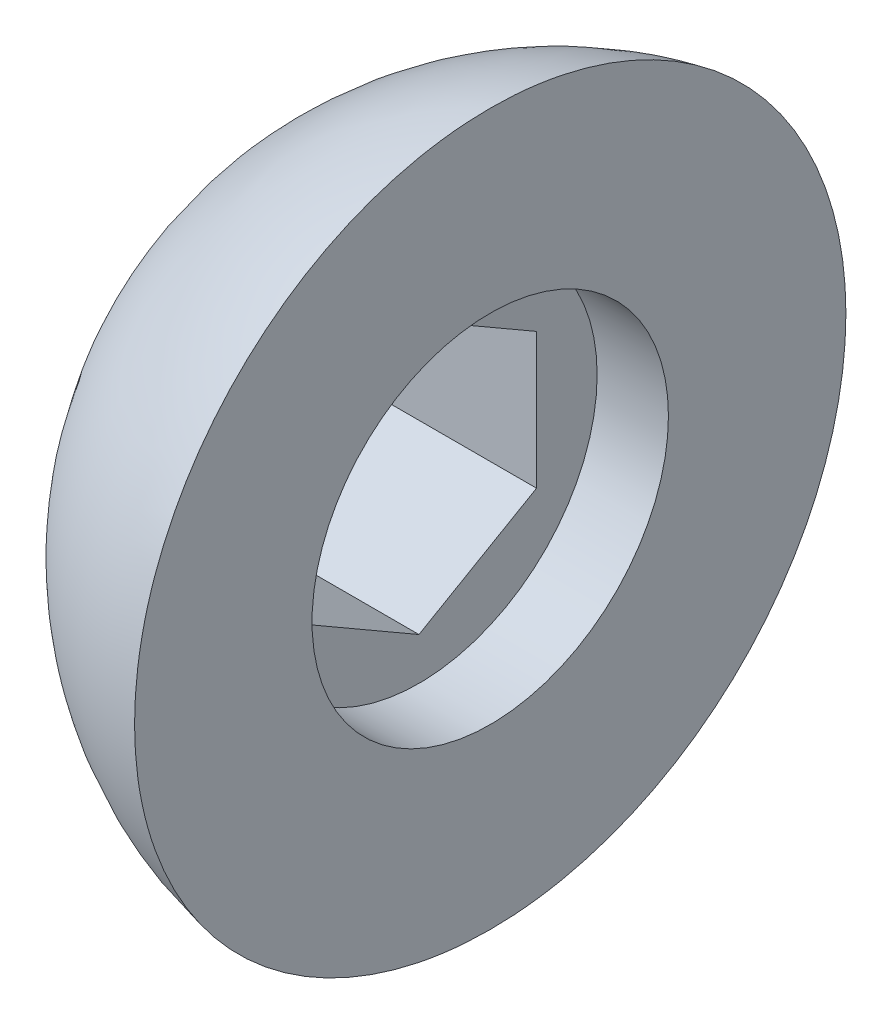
ISO-10303-21;
HEADER;
FILE_DESCRIPTION(('STEP AP214'),'2;1');
FILE_NAME('part.step','',(''),(''),'','','');
FILE_SCHEMA(('AUTOMOTIVE_DESIGN { 1 0 10303 214 1 1 1 1 }'));
ENDSEC;
DATA;
#1=APPLICATION_CONTEXT('core data for automotive mechanical design processes');
#2=APPLICATION_PROTOCOL_DEFINITION('international standard','automotive_design',2000,#1);
#3=PRODUCT_CONTEXT('',#1,'mechanical');
#4=PRODUCT('Part','Part','',(#3));
#5=PRODUCT_RELATED_PRODUCT_CATEGORY('part','',(#4));
#6=PRODUCT_DEFINITION_FORMATION('','',#4);
#7=PRODUCT_DEFINITION_CONTEXT('part definition',#1,'design');
#8=PRODUCT_DEFINITION('design','',#6,#7);
#9=PRODUCT_DEFINITION_SHAPE('','',#8);
#10=(LENGTH_UNIT() NAMED_UNIT(*) SI_UNIT(.MILLI.,.METRE.));
#11=(NAMED_UNIT(*) PLANE_ANGLE_UNIT() SI_UNIT($,.RADIAN.));
#12=(NAMED_UNIT(*) SI_UNIT($,.STERADIAN.) SOLID_ANGLE_UNIT());
#13=UNCERTAINTY_MEASURE_WITH_UNIT(LENGTH_MEASURE(1.E-05),#10,'distance_accuracy_value','');
#14=(GEOMETRIC_REPRESENTATION_CONTEXT(3) GLOBAL_UNCERTAINTY_ASSIGNED_CONTEXT((#13)) GLOBAL_UNIT_ASSIGNED_CONTEXT((#10,
#11,#12)) REPRESENTATION_CONTEXT('',''));
#15=CARTESIAN_POINT('',(0.,0.,0.));
#16=DIRECTION('',(0.,0.,1.));
#17=DIRECTION('',(1.,0.,0.));
#18=AXIS2_PLACEMENT_3D('',#15,#16,#17);
#19=CARTESIAN_POINT('',(1.92607341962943,-0.952499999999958,-1.64977839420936));
#20=DIRECTION('',(0.,0.,-1.));
#21=DIRECTION('',(-1.,0.,0.));
#22=AXIS2_PLACEMENT_3D('',#19,#20,#21);
#23=PLANE('',#22);
#24=DIRECTION('',(0.,-1.,0.));
#25=VECTOR('',#24,1.);
#26=CARTESIAN_POINT('',(0.926073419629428,-0.952499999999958,-1.64977839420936));
#27=LINE('',#26,#25);
#28=CARTESIAN_POINT('',(0.926073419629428,0.952500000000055,-1.64977839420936));
#29=VERTEX_POINT('',#28);
#30=CARTESIAN_POINT('',(0.926073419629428,-0.952499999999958,-1.64977839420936));
#31=VERTEX_POINT('',#30);
#32=EDGE_CURVE('E85',#29,#31,#27,.T.);
#33=ORIENTED_EDGE('',*,*,#32,.F.);
#34=DIRECTION('',(-1.,0.,0.));
#35=VECTOR('',#34,1.);
#36=CARTESIAN_POINT('',(1.92607341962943,0.952500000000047,-1.64977839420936));
#37=LINE('',#36,#35);
#38=CARTESIAN_POINT('',(-1.83071261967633,0.95250000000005,-1.64977839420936));
#39=VERTEX_POINT('',#38);
#40=EDGE_CURVE('E79',#29,#39,#37,.T.);
#41=ORIENTED_EDGE('',*,*,#40,.T.);
#42=CARTESIAN_POINT('',(-1.83071261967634,-0.952499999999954,-1.64977839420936));
#43=CARTESIAN_POINT('',(-1.84350674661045,-0.88924794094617,-1.64977839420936));
#44=CARTESIAN_POINT('',(-1.85502505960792,-0.825737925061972,-1.64977839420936));
#45=CARTESIAN_POINT('',(-1.87542994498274,-0.698708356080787,-1.64977839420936));
#46=CARTESIAN_POINT('',(-1.88433269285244,-0.635191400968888,-1.64977839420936));
#47=CARTESIAN_POINT('',(-1.8995522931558,-0.508153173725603,-1.64977839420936));
#48=CARTESIAN_POINT('',(-1.90588117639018,-0.444633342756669,-1.64977839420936));
#49=CARTESIAN_POINT('',(-1.91598737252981,-0.317593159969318,-1.64977839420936));
#50=CARTESIAN_POINT('',(-1.91977268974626,-0.254073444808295,-1.64977839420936));
#51=CARTESIAN_POINT('',(-1.92481369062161,-0.127035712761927,-1.64977839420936));
#52=CARTESIAN_POINT('',(-1.92607341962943,-0.063517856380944,-1.64977839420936));
#53=CARTESIAN_POINT('',(-1.92607341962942,0.0635178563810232,-1.64977839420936));
#54=CARTESIAN_POINT('',(-1.92481369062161,0.127035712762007,-1.64977839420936));
#55=CARTESIAN_POINT('',(-1.91977268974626,0.254073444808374,-1.64977839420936));
#56=CARTESIAN_POINT('',(-1.9159873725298,0.317593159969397,-1.64977839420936));
#57=CARTESIAN_POINT('',(-1.90588117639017,0.444633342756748,-1.64977839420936));
#58=CARTESIAN_POINT('',(-1.89955229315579,0.508153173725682,-1.64977839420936));
#59=CARTESIAN_POINT('',(-1.88433269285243,0.635191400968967,-1.64977839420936));
#60=CARTESIAN_POINT('',(-1.87542994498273,0.698708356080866,-1.64977839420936));
#61=CARTESIAN_POINT('',(-1.8550250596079,0.82573792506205,-1.64977839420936));
#62=CARTESIAN_POINT('',(-1.84350674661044,0.889247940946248,-1.64977839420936));
#63=CARTESIAN_POINT('',(-1.83071261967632,0.952500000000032,-1.64977839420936));
#64=B_SPLINE_CURVE_WITH_KNOTS('',3,(#42,#43,#44,#45,#46,#47,#48,#49,#50,#51,#52,#53,#54,#55,#56,
#57,#58,#59,#60,#61,#62,#63),.UNSPECIFIED.,.F.,.F.,(4,2,2,2,2,2,2,2,2,2,4),(0.,
0.193585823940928,0.385947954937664,0.577400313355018,0.76824733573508,0.958788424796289,
1.1493295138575,1.34017653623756,1.53162889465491,1.72399102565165,1.91757684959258),.UNSPECIFIED.);
#65=CARTESIAN_POINT('',(-1.83071261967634,-0.952499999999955,-1.64977839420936));
#66=VERTEX_POINT('',#65);
#67=EDGE_CURVE('E83',#66,#39,#64,.T.);
#68=ORIENTED_EDGE('',*,*,#67,.F.);
#69=DIRECTION('',(-1.,0.,0.));
#70=VECTOR('',#69,1.);
#71=CARTESIAN_POINT('',(1.92607341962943,-0.952499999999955,-1.64977839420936));
#72=LINE('',#71,#70);
#73=EDGE_CURVE('E88',#66,#31,#72,.F.);
#74=ORIENTED_EDGE('',*,*,#73,.T.);
#75=EDGE_LOOP('',(#33,#41,#68,#74));
#76=FACE_BOUND('',#75,.T.);
#77=ADVANCED_FACE('F33',(#76),#23,.F.);
#78=CARTESIAN_POINT('',(1.92607341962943,0.952500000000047,-1.64977839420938));
#79=DIRECTION('',(0.,0.866025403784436,-0.500000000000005));
#80=DIRECTION('',(-1.,0.,0.));
#81=AXIS2_PLACEMENT_3D('',#78,#79,#80);
#82=PLANE('',#81);
#83=DIRECTION('',(0.,-0.500000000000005,-0.866025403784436));
#84=VECTOR('',#83,1.);
#85=CARTESIAN_POINT('',(0.926073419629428,0.952500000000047,-1.64977839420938));
#86=LINE('',#85,#84);
#87=CARTESIAN_POINT('',(0.926073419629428,1.90500000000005,0.));
#88=VERTEX_POINT('',#87);
#89=EDGE_CURVE('E254',#88,#29,#86,.T.);
#90=ORIENTED_EDGE('',*,*,#89,.F.);
#91=DIRECTION('',(-1.,0.,0.));
#92=VECTOR('',#91,1.);
#93=CARTESIAN_POINT('',(1.92607341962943,1.90500000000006,0.));
#94=LINE('',#93,#92);
#95=CARTESIAN_POINT('',(-1.83071261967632,1.90500000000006,0.));
#96=VERTEX_POINT('',#95);
#97=EDGE_CURVE('E93',#88,#96,#94,.T.);
#98=ORIENTED_EDGE('',*,*,#97,.T.);
#99=CARTESIAN_POINT('',(-1.83071261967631,0.952500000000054,-1.64977839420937));
#100=CARTESIAN_POINT('',(-1.86193177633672,1.02961650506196,-1.51620868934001));
#101=CARTESIAN_POINT('',(-1.88552563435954,1.10749986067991,-1.38131076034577));
#102=CARTESIAN_POINT('',(-1.91719086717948,1.26329147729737,-1.11147176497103));
#103=CARTESIAN_POINT('',(-1.9254099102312,1.34119223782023,-0.97654368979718));
#104=CARTESIAN_POINT('',(-1.92668505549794,1.50020684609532,-0.70112230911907));
#105=CARTESIAN_POINT('',(-1.91910885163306,1.58132211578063,-0.560626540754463));
#106=CARTESIAN_POINT('',(-1.8874615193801,1.74357554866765,-0.279595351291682));
#107=CARTESIAN_POINT('',(-1.86322378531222,1.82470559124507,-0.139073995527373));
#108=CARTESIAN_POINT('',(-1.8307126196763,1.90500000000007,0.));
#109=B_SPLINE_CURVE_WITH_KNOTS('',3,(#99,#100,#101,#102,#103,#104,#105,#106,#107,#108),
.UNSPECIFIED.,.F.,.F.,(4,2,2,2,4),(0.,0.471876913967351,0.939197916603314,1.42558491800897,
1.91690763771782),.UNSPECIFIED.);
#110=EDGE_CURVE('E90',#39,#96,#109,.T.);
#111=ORIENTED_EDGE('',*,*,#110,.F.);
#112=ORIENTED_EDGE('',*,*,#40,.F.);
#113=EDGE_LOOP('',(#90,#98,#111,#112));
#114=FACE_BOUND('',#113,.T.);
#115=ADVANCED_FACE('F91',(#114),#82,.F.);
#116=CARTESIAN_POINT('',(1.92607341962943,-1.90499999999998,0.));
#117=DIRECTION('',(0.,-0.866025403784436,-0.500000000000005));
#118=DIRECTION('',(-1.,0.,0.));
#119=AXIS2_PLACEMENT_3D('',#116,#117,#118);
#120=PLANE('',#119);
#121=DIRECTION('',(0.,-0.500000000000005,0.866025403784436));
#122=VECTOR('',#121,1.);
#123=CARTESIAN_POINT('',(0.926073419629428,-1.90499999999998,0.));
#124=LINE('',#123,#122);
#125=CARTESIAN_POINT('',(0.926073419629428,-1.90499999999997,0.));
#126=VERTEX_POINT('',#125);
#127=EDGE_CURVE('E48',#31,#126,#124,.T.);
#128=ORIENTED_EDGE('',*,*,#127,.F.);
#129=ORIENTED_EDGE('',*,*,#73,.F.);
#130=CARTESIAN_POINT('',(-1.83071261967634,-1.90499999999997,0.));
#131=CARTESIAN_POINT('',(-1.86193177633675,-1.82788349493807,-0.133569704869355));
#132=CARTESIAN_POINT('',(-1.88552563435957,-1.75000013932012,-0.268467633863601));
#133=CARTESIAN_POINT('',(-1.91719086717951,-1.59420852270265,-0.538306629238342));
#134=CARTESIAN_POINT('',(-1.92540991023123,-1.5163077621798,-0.673234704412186));
#135=CARTESIAN_POINT('',(-1.92668505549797,-1.35729315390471,-0.948656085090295));
#136=CARTESIAN_POINT('',(-1.91910885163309,-1.2761778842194,-1.0891518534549));
#137=CARTESIAN_POINT('',(-1.88746151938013,-1.11392445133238,-1.37018304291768));
#138=CARTESIAN_POINT('',(-1.86322378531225,-1.03279440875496,-1.51070439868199));
#139=CARTESIAN_POINT('',(-1.83071261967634,-0.952499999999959,-1.64977839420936));
#140=B_SPLINE_CURVE_WITH_KNOTS('',3,(#130,#131,#132,#133,#134,#135,#136,#137,#138,#139),
.UNSPECIFIED.,.F.,.F.,(4,2,2,2,4),(0.,0.47187691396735,0.939197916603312,1.42558491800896,
1.91690763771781),.UNSPECIFIED.);
#141=CARTESIAN_POINT('',(-1.83071261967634,-1.90499999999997,0.));
#142=VERTEX_POINT('',#141);
#143=EDGE_CURVE('E101',#142,#66,#140,.T.);
#144=ORIENTED_EDGE('',*,*,#143,.F.);
#145=DIRECTION('',(-1.,0.,0.));
#146=VECTOR('',#145,1.);
#147=CARTESIAN_POINT('',(1.92607341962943,-1.90499999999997,0.));
#148=LINE('',#147,#146);
#149=EDGE_CURVE('E260',#142,#126,#148,.F.);
#150=ORIENTED_EDGE('',*,*,#149,.T.);
#151=EDGE_LOOP('',(#128,#129,#144,#150));
#152=FACE_BOUND('',#151,.T.);
#153=ADVANCED_FACE('F165',(#152),#120,.F.);
#154=CARTESIAN_POINT('',(-1.96459488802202,0.952500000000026,1.64977839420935));
#155=DIRECTION('',(0.,0.866025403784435,0.500000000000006));
#156=DIRECTION('',(1.,0.,0.));
#157=AXIS2_PLACEMENT_3D('',#154,#155,#156);
#158=PLANE('',#157);
#159=DIRECTION('',(0.,0.500000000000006,-0.866025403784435));
#160=VECTOR('',#159,1.);
#161=CARTESIAN_POINT('',(0.926073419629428,0.952500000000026,1.64977839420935));
#162=LINE('',#161,#160);
#163=CARTESIAN_POINT('',(0.926073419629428,0.952500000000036,1.64977839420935));
#164=VERTEX_POINT('',#163);
#165=EDGE_CURVE('E251',#164,#88,#162,.T.);
#166=ORIENTED_EDGE('',*,*,#165,.F.);
#167=DIRECTION('',(1.,0.,0.));
#168=VECTOR('',#167,1.);
#169=CARTESIAN_POINT('',(-1.96459488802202,0.952500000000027,1.64977839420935));
#170=LINE('',#169,#168);
#171=CARTESIAN_POINT('',(-1.83071261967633,0.952500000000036,1.64977839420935));
#172=VERTEX_POINT('',#171);
#173=EDGE_CURVE('E261',#164,#172,#170,.F.);
#174=ORIENTED_EDGE('',*,*,#173,.T.);
#175=CARTESIAN_POINT('',(-1.83071261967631,1.90500000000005,0.));
#176=CARTESIAN_POINT('',(-1.84350674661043,1.87337397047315,0.05477788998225));
#177=CARTESIAN_POINT('',(-1.85502505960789,1.84161896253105,0.109779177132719));
#178=CARTESIAN_POINT('',(-1.87542994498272,1.77810417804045,0.219790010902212));
#179=CARTESIAN_POINT('',(-1.88433269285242,1.7463457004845,0.274797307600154));
#180=CARTESIAN_POINT('',(-1.89955229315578,1.68282658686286,0.38481563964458));
#181=CARTESIAN_POINT('',(-1.90588117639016,1.65106667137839,0.439825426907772));
#182=CARTESIAN_POINT('',(-1.9159873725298,1.58754657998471,0.549845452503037));
#183=CARTESIAN_POINT('',(-1.91977268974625,1.5557867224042,0.604855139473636));
#184=CARTESIAN_POINT('',(-1.9248136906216,1.49226785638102,0.714873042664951));
#185=CARTESIAN_POINT('',(-1.92607341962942,1.46050892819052,0.769881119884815));
#186=CARTESIAN_POINT('',(-1.92607341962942,1.39699107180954,0.879897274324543));
#187=CARTESIAN_POINT('',(-1.92481369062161,1.36523214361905,0.934905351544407));
#188=CARTESIAN_POINT('',(-1.91977268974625,1.30171327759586,1.04492325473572));
#189=CARTESIAN_POINT('',(-1.9159873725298,1.26995342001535,1.09993294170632));
#190=CARTESIAN_POINT('',(-1.90588117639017,1.20643332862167,1.20995296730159));
#191=CARTESIAN_POINT('',(-1.89955229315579,1.1746734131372,1.26496275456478));
#192=CARTESIAN_POINT('',(-1.88433269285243,1.11115429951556,1.3749810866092));
#193=CARTESIAN_POINT('',(-1.87542994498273,1.07939582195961,1.42998838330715));
#194=CARTESIAN_POINT('',(-1.8550250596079,1.01588103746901,1.53999921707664));
#195=CARTESIAN_POINT('',(-1.84350674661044,0.984126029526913,1.59500050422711));
#196=CARTESIAN_POINT('',(-1.83071261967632,0.952500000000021,1.64977839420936));
#197=B_SPLINE_CURVE_WITH_KNOTS('',3,(#175,#176,#177,#178,#179,#180,#181,#182,#183,#184,#185,
#186,#187,#188,#189,#190,#191,#192,#193,#194,#195,#196),.UNSPECIFIED.,.F.,.F.,(4,2,2,2,2,2,2,2,
2,2,4),(0.,0.193585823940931,0.385947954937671,0.577400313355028,0.768247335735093,
0.958788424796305,1.14932951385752,1.34017653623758,1.53162889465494,1.72399102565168,
1.91757684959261),.UNSPECIFIED.);
#198=EDGE_CURVE('E138',#96,#172,#197,.T.);
#199=ORIENTED_EDGE('',*,*,#198,.F.);
#200=ORIENTED_EDGE('',*,*,#97,.F.);
#201=EDGE_LOOP('',(#166,#174,#199,#200));
#202=FACE_BOUND('',#201,.T.);
#203=ADVANCED_FACE('F161',(#202),#158,.F.);
#204=CARTESIAN_POINT('',(-1.96459488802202,-0.952499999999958,1.64977839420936));
#205=DIRECTION('',(0.,0.,1.));
#206=DIRECTION('',(1.,0.,0.));
#207=AXIS2_PLACEMENT_3D('',#204,#205,#206);
#208=PLANE('',#207);
#209=DIRECTION('',(0.,1.,0.));
#210=VECTOR('',#209,1.);
#211=CARTESIAN_POINT('',(0.926073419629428,-0.952499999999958,1.64977839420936));
#212=LINE('',#211,#210);
#213=CARTESIAN_POINT('',(0.926073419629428,-0.95249999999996,1.64977839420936));
#214=VERTEX_POINT('',#213);
#215=EDGE_CURVE('E246',#214,#164,#212,.T.);
#216=ORIENTED_EDGE('',*,*,#215,.F.);
#217=DIRECTION('',(1.,0.,0.));
#218=VECTOR('',#217,1.);
#219=CARTESIAN_POINT('',(-1.96459488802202,-0.952499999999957,1.64977839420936));
#220=LINE('',#219,#218);
#221=CARTESIAN_POINT('',(-1.83071261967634,-0.952499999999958,1.64977839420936));
#222=VERTEX_POINT('',#221);
#223=EDGE_CURVE('E57',#214,#222,#220,.F.);
#224=ORIENTED_EDGE('',*,*,#223,.T.);
#225=CARTESIAN_POINT('',(-1.83071261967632,0.952500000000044,1.64977839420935));
#226=CARTESIAN_POINT('',(-1.84350674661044,0.889247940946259,1.64977839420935));
#227=CARTESIAN_POINT('',(-1.8550250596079,0.825737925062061,1.64977839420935));
#228=CARTESIAN_POINT('',(-1.87542994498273,0.698708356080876,1.64977839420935));
#229=CARTESIAN_POINT('',(-1.88433269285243,0.635191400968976,1.64977839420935));
#230=CARTESIAN_POINT('',(-1.89955229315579,0.508153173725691,1.64977839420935));
#231=CARTESIAN_POINT('',(-1.90588117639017,0.444633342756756,1.64977839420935));
#232=CARTESIAN_POINT('',(-1.91598737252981,0.317593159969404,1.64977839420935));
#233=CARTESIAN_POINT('',(-1.91977268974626,0.254073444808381,1.64977839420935));
#234=CARTESIAN_POINT('',(-1.92481369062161,0.127035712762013,1.64977839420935));
#235=CARTESIAN_POINT('',(-1.92607341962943,0.0635178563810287,1.64977839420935));
#236=CARTESIAN_POINT('',(-1.92607341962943,-0.0635178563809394,1.64977839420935));
#237=CARTESIAN_POINT('',(-1.92481369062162,-0.127035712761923,1.64977839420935));
#238=CARTESIAN_POINT('',(-1.91977268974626,-0.254073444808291,1.64977839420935));
#239=CARTESIAN_POINT('',(-1.91598737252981,-0.317593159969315,1.64977839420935));
#240=CARTESIAN_POINT('',(-1.90588117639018,-0.444633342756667,1.64977839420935));
#241=CARTESIAN_POINT('',(-1.8995522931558,-0.508153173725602,1.64977839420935));
#242=CARTESIAN_POINT('',(-1.88433269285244,-0.635191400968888,1.64977839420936));
#243=CARTESIAN_POINT('',(-1.87542994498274,-0.698708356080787,1.64977839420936));
#244=CARTESIAN_POINT('',(-1.85502505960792,-0.825737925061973,1.64977839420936));
#245=CARTESIAN_POINT('',(-1.84350674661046,-0.889247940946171,1.64977839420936));
#246=CARTESIAN_POINT('',(-1.83071261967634,-0.952499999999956,1.64977839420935));
#247=B_SPLINE_CURVE_WITH_KNOTS('',3,(#225,#226,#227,#228,#229,#230,#231,#232,#233,#234,#235,
#236,#237,#238,#239,#240,#241,#242,#243,#244,#245,#246),.UNSPECIFIED.,.F.,.F.,(4,2,2,2,2,2,2,2,
2,2,4),(0.,0.193585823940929,0.385947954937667,0.577400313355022,0.768247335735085,
0.958788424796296,1.14932951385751,1.34017653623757,1.53162889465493,1.72399102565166,
1.91757684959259),.UNSPECIFIED.);
#248=EDGE_CURVE('E153',#172,#222,#247,.T.);
#249=ORIENTED_EDGE('',*,*,#248,.F.);
#250=ORIENTED_EDGE('',*,*,#173,.F.);
#251=EDGE_LOOP('',(#216,#224,#249,#250));
#252=FACE_BOUND('',#251,.T.);
#253=ADVANCED_FACE('F158',(#252),#208,.F.);
#254=CARTESIAN_POINT('',(-1.96459488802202,-1.90499999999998,0.));
#255=DIRECTION('',(0.,-0.866025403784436,0.500000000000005));
#256=DIRECTION('',(1.,0.,0.));
#257=AXIS2_PLACEMENT_3D('',#254,#255,#256);
#258=PLANE('',#257);
#259=DIRECTION('',(0.,0.500000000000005,0.866025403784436));
#260=VECTOR('',#259,1.);
#261=CARTESIAN_POINT('',(0.926073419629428,-1.90499999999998,0.));
#262=LINE('',#261,#260);
#263=EDGE_CURVE('E11',#126,#214,#262,.T.);
#264=ORIENTED_EDGE('',*,*,#263,.F.);
#265=ORIENTED_EDGE('',*,*,#149,.F.);
#266=CARTESIAN_POINT('',(-1.83071261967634,-0.95249999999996,1.64977839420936));
#267=CARTESIAN_POINT('',(-1.84350674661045,-0.984126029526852,1.59500050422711));
#268=CARTESIAN_POINT('',(-1.85502505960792,-1.01588103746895,1.53999921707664));
#269=CARTESIAN_POINT('',(-1.87542994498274,-1.07939582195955,1.42998838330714));
#270=CARTESIAN_POINT('',(-1.88433269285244,-1.1111542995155,1.3749810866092));
#271=CARTESIAN_POINT('',(-1.89955229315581,-1.17467341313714,1.26496275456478));
#272=CARTESIAN_POINT('',(-1.90588117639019,-1.20643332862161,1.20995296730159));
#273=CARTESIAN_POINT('',(-1.91598737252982,-1.26995342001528,1.09993294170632));
#274=CARTESIAN_POINT('',(-1.91977268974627,-1.3017132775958,1.04492325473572));
#275=CARTESIAN_POINT('',(-1.92481369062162,-1.36523214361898,0.934905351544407));
#276=CARTESIAN_POINT('',(-1.92607341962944,-1.39699107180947,0.879897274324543));
#277=CARTESIAN_POINT('',(-1.92607341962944,-1.46050892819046,0.769881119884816));
#278=CARTESIAN_POINT('',(-1.92481369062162,-1.49226785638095,0.714873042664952));
#279=CARTESIAN_POINT('',(-1.91977268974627,-1.55578672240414,0.604855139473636));
#280=CARTESIAN_POINT('',(-1.91598737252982,-1.58754657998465,0.549845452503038));
#281=CARTESIAN_POINT('',(-1.90588117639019,-1.65106667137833,0.439825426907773));
#282=CARTESIAN_POINT('',(-1.89955229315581,-1.68282658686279,0.384815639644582));
#283=CARTESIAN_POINT('',(-1.88433269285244,-1.74634570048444,0.274797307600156));
#284=CARTESIAN_POINT('',(-1.87542994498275,-1.77810417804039,0.219790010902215));
#285=CARTESIAN_POINT('',(-1.85502505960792,-1.84161896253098,0.10977917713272));
#286=CARTESIAN_POINT('',(-1.84350674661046,-1.87337397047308,0.0547778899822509));
#287=CARTESIAN_POINT('',(-1.83071261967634,-1.90499999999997,0.));
#288=B_SPLINE_CURVE_WITH_KNOTS('',3,(#266,#267,#268,#269,#270,#271,#272,#273,#274,#275,#276,
#277,#278,#279,#280,#281,#282,#283,#284,#285,#286,#287),.UNSPECIFIED.,.F.,.F.,(4,2,2,2,2,2,2,2,
2,2,4),(0.,0.193585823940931,0.385947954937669,0.577400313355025,0.768247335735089,
0.958788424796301,1.14932951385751,1.34017653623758,1.53162889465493,1.72399102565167,
1.9175768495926),.UNSPECIFIED.);
#289=EDGE_CURVE('E42',#222,#142,#288,.T.);
#290=ORIENTED_EDGE('',*,*,#289,.F.);
#291=ORIENTED_EDGE('',*,*,#223,.F.);
#292=EDGE_LOOP('',(#264,#265,#290,#291));
#293=FACE_BOUND('',#292,.T.);
#294=ADVANCED_FACE('F35',(#293),#258,.F.);
#295=CARTESIAN_POINT('',(1.92607341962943,-4.9899041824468,4.9899041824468));
#296=DIRECTION('',(1.,0.,0.));
#297=DIRECTION('',(0.,0.,-1.));
#298=AXIS2_PLACEMENT_3D('',#295,#296,#297);
#299=PLANE('',#298);
#300=CARTESIAN_POINT('',(1.92607341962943,0.,0.));
#301=DIRECTION('',(1.,0.,0.));
#302=DIRECTION('',(0.,0.,-1.));
#303=AXIS2_PLACEMENT_3D('',#300,#301,#302);
#304=CIRCLE('',#303,2.5);
#305=CARTESIAN_POINT('',(1.92607341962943,0.,-2.5));
#306=VERTEX_POINT('',#305);
#307=EDGE_CURVE('E244',#306,#306,#304,.T.);
#308=ORIENTED_EDGE('',*,*,#307,.F.);
#309=EDGE_LOOP('',(#308));
#310=FACE_BOUND('',#309,.T.);
#311=CARTESIAN_POINT('',(1.92607341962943,0.,0.));
#312=DIRECTION('',(1.,0.,0.));
#313=DIRECTION('',(0.,0.,-1.));
#314=AXIS2_PLACEMENT_3D('',#311,#312,#313);
#315=CIRCLE('',#314,4.9899041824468);
#316=CARTESIAN_POINT('',(1.92607341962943,0.,-4.9899041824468));
#317=VERTEX_POINT('',#316);
#318=EDGE_CURVE('E263',#317,#317,#315,.F.);
#319=ORIENTED_EDGE('',*,*,#318,.F.);
#320=EDGE_LOOP('',(#319));
#321=FACE_BOUND('',#320,.T.);
#322=ADVANCED_FACE('F126',(#310,#321),#299,.T.);
#323=CARTESIAN_POINT('',(1.92607341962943,4.9899041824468,0.));
#324=CARTESIAN_POINT('',(1.92607341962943,4.9899041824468,4.9899041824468));
#325=CARTESIAN_POINT('',(1.92607341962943,0.,4.9899041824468));
#326=CARTESIAN_POINT('',(1.92607341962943,-4.9899041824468,4.9899041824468));
#327=CARTESIAN_POINT('',(1.92607341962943,-4.9899041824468,0.));
#328=CARTESIAN_POINT('',(1.92607341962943,-4.9899041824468,-4.9899041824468));
#329=CARTESIAN_POINT('',(1.92607341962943,0.,-4.9899041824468));
#330=CARTESIAN_POINT('',(1.92607341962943,4.9899041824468,-4.9899041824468));
#331=CARTESIAN_POINT('',(1.92607341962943,4.9899041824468,0.));
#332=CARTESIAN_POINT('',(-0.968920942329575,4.43729194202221,0.));
#333=CARTESIAN_POINT('',(-0.968920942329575,4.43729194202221,4.43729194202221));
#334=CARTESIAN_POINT('',(-0.968920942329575,0.,4.43729194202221));
#335=CARTESIAN_POINT('',(-0.968920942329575,-4.43729194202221,4.43729194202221));
#336=CARTESIAN_POINT('',(-0.968920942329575,-4.43729194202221,0.));
#337=CARTESIAN_POINT('',(-0.968920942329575,-4.43729194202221,-4.43729194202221));
#338=CARTESIAN_POINT('',(-0.968920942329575,0.,-4.43729194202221));
#339=CARTESIAN_POINT('',(-0.968920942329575,4.43729194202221,-4.43729194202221));
#340=CARTESIAN_POINT('',(-0.968920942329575,4.43729194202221,0.));
#341=CARTESIAN_POINT('',(-1.92607341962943,1.64977839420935,0.));
#342=CARTESIAN_POINT('',(-1.92607341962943,1.64977839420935,1.64977839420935));
#343=CARTESIAN_POINT('',(-1.92607341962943,0.,1.64977839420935));
#344=CARTESIAN_POINT('',(-1.92607341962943,-1.64977839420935,1.64977839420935));
#345=CARTESIAN_POINT('',(-1.92607341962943,-1.64977839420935,0.));
#346=CARTESIAN_POINT('',(-1.92607341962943,-1.64977839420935,-1.64977839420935));
#347=CARTESIAN_POINT('',(-1.92607341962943,0.,-1.64977839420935));
#348=CARTESIAN_POINT('',(-1.92607341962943,1.64977839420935,-1.64977839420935));
#349=CARTESIAN_POINT('',(-1.92607341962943,1.64977839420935,0.));
#350=CARTESIAN_POINT('',(-1.93435247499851,1.62566731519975,0.));
#351=CARTESIAN_POINT('',(-1.93435247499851,1.62566731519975,1.62566731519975));
#352=CARTESIAN_POINT('',(-1.93435247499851,0.,1.62566731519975));
#353=CARTESIAN_POINT('',(-1.93435247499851,-1.62566731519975,1.62566731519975));
#354=CARTESIAN_POINT('',(-1.93435247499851,-1.62566731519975,0.));
#355=CARTESIAN_POINT('',(-1.93435247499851,-1.62566731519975,-1.62566731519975));
#356=CARTESIAN_POINT('',(-1.93435247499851,0.,-1.62566731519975));
#357=CARTESIAN_POINT('',(-1.93435247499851,1.62566731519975,-1.62566731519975));
#358=CARTESIAN_POINT('',(-1.93435247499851,1.62566731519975,0.));
#359=CARTESIAN_POINT('',(-1.94263153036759,1.60155623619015,0.));
#360=CARTESIAN_POINT('',(-1.94263153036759,1.60155623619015,1.60155623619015));
#361=CARTESIAN_POINT('',(-1.94263153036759,0.,1.60155623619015));
#362=CARTESIAN_POINT('',(-1.94263153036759,-1.60155623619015,1.60155623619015));
#363=CARTESIAN_POINT('',(-1.94263153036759,-1.60155623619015,0.));
#364=CARTESIAN_POINT('',(-1.94263153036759,-1.60155623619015,-1.60155623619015));
#365=CARTESIAN_POINT('',(-1.94263153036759,0.,-1.60155623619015));
#366=CARTESIAN_POINT('',(-1.94263153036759,1.60155623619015,-1.60155623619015));
#367=CARTESIAN_POINT('',(-1.94263153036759,1.60155623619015,0.));
#368=(BOUNDED_SURFACE() B_SPLINE_SURFACE(2,2,((#323,#324,#325,#326,#327,#328,#329,#330,#331),
(#332,#333,#334,#335,#336,#337,#338,#339,#340),(#341,#342,#343,#344,#345,#346,#347,#348,#349),
(#350,#351,#352,#353,#354,#355,#356,#357,#358),(#359,#360,#361,#362,#363,#364,#365,#366,#367)),
.UNSPECIFIED.,.F.,.T.,.F.) B_SPLINE_SURFACE_WITH_KNOTS((3,2,3),(3,2,2,2,3),(0.188616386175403,
1.24003886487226,1.25055308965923),(0.,1.5707963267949,3.14159265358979,4.71238898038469,
6.28318530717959),.UNSPECIFIED.) GEOMETRIC_REPRESENTATION_ITEM() RATIONAL_B_SPLINE_SURFACE(((1.,
0.707106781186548,1.,0.707106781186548,1.,0.707106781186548,1.,0.707106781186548,1.),
(0.864967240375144,0.611624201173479,0.864967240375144,0.611624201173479,0.864967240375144,
0.611624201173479,0.864967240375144,0.611624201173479,0.864967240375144),(1.,0.707106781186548,
1.,0.707106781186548,1.,0.707106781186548,1.,0.707106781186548,1.),(1.,0.707106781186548,1.,
0.707106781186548,1.,0.707106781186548,1.,0.707106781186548,1.),(1.,0.707106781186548,1.,
0.707106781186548,1.,0.707106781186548,1.,0.707106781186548,1.))) REPRESENTATION_ITEM('') SURFACE());
#369=ORIENTED_EDGE('',*,*,#318,.T.);
#370=EDGE_LOOP('',(#369));
#371=FACE_BOUND('',#370,.T.);
#372=ORIENTED_EDGE('',*,*,#248,.T.);
#373=ORIENTED_EDGE('',*,*,#289,.T.);
#374=ORIENTED_EDGE('',*,*,#143,.T.);
#375=ORIENTED_EDGE('',*,*,#67,.T.);
#376=ORIENTED_EDGE('',*,*,#110,.T.);
#377=ORIENTED_EDGE('',*,*,#198,.T.);
#378=EDGE_LOOP('',(#372,#373,#374,#375,#376,#377));
#379=FACE_BOUND('',#378,.T.);
#380=ADVANCED_FACE('F99',(#371,#379),#368,.T.);
#381=CARTESIAN_POINT('',(0.926073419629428,0.,0.));
#382=DIRECTION('',(1.,0.,0.));
#383=DIRECTION('',(0.,0.,-1.));
#384=AXIS2_PLACEMENT_3D('',#381,#382,#383);
#385=PLANE('',#384);
#386=CARTESIAN_POINT('',(0.926073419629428,0.,0.));
#387=DIRECTION('',(1.,0.,0.));
#388=DIRECTION('',(0.,0.,-1.));
#389=AXIS2_PLACEMENT_3D('',#386,#387,#388);
#390=CIRCLE('',#389,2.5);
#391=CARTESIAN_POINT('',(0.926073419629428,0.,-2.5));
#392=VERTEX_POINT('',#391);
#393=EDGE_CURVE('E241',#392,#392,#390,.T.);
#394=ORIENTED_EDGE('',*,*,#393,.T.);
#395=EDGE_LOOP('',(#394));
#396=FACE_BOUND('',#395,.T.);
#397=ORIENTED_EDGE('',*,*,#32,.T.);
#398=ORIENTED_EDGE('',*,*,#127,.T.);
#399=ORIENTED_EDGE('',*,*,#263,.T.);
#400=ORIENTED_EDGE('',*,*,#215,.T.);
#401=ORIENTED_EDGE('',*,*,#165,.T.);
#402=ORIENTED_EDGE('',*,*,#89,.T.);
#403=EDGE_LOOP('',(#397,#398,#399,#400,#401,#402));
#404=FACE_BOUND('',#403,.T.);
#405=ADVANCED_FACE('F125',(#396,#404),#385,.T.);
#406=CARTESIAN_POINT('',(0.926073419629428,0.,0.));
#407=DIRECTION('',(1.,0.,0.));
#408=DIRECTION('',(0.,0.,-1.));
#409=AXIS2_PLACEMENT_3D('',#406,#407,#408);
#410=CYLINDRICAL_SURFACE('',#409,2.5);
#411=ORIENTED_EDGE('',*,*,#393,.F.);
#412=EDGE_LOOP('',(#411));
#413=FACE_BOUND('',#412,.T.);
#414=ORIENTED_EDGE('',*,*,#307,.T.);
#415=EDGE_LOOP('',(#414));
#416=FACE_BOUND('',#415,.T.);
#417=ADVANCED_FACE('F128',(#413,#416),#410,.F.);
#418=CLOSED_SHELL('',(#77,#115,#153,#203,#253,#294,#322,#380,#405,#417));
#419=MANIFOLD_SOLID_BREP('B2',#418);
#420=ADVANCED_BREP_SHAPE_REPRESENTATION('',(#18,#419),#14);
#421=SHAPE_DEFINITION_REPRESENTATION(#9,#420);
ENDSEC;
END-ISO-10303-21;
